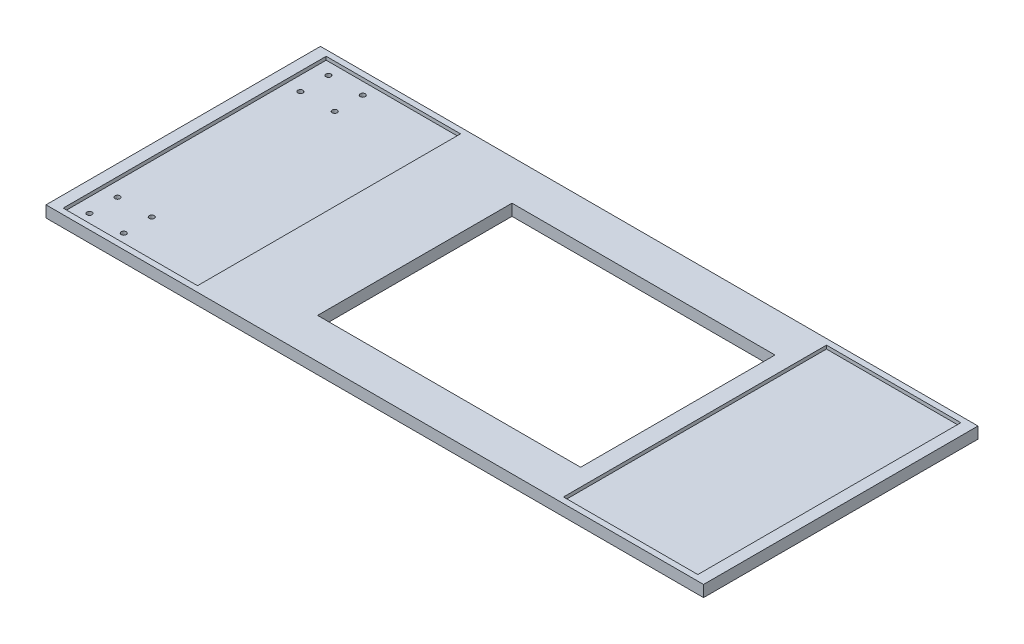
from build123d import *

# Parameters (mm, degrees)
SKETCH_1_W               = 575
SKETCH_1_H               = 240
EXTRUDE_1_DEPTH          = 31.5
SKETCH_2_W               = 117.5
SKETCH_2_H               = 230
CUT_EXTRUDE_1_DEPTH      = 24.5
SKETCH_3_W               = 230
SKETCH_3_H               = 170
CUT_EXTRUDE_2_DEPTH      = 314.126971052
SKETCH_4_R               = 9
EXTRUDE_2_DEPTH          = 5
SKETCH_5_R               = 6
SKETCH_5_R_2             = 4
CUT_EXTRUDE_3_DEPTH      = 10
SKETCH_6_R               = 2.2
CUT_EXTRUDE_4_DEPTH      = 10
EXTRUDE_3_DEPTH          = 31.5
HOLE_WIZARD_M10_1_D      = 8.5
HOLE_WIZARD_M10_1_DEPTH  = 31
HOLE_WIZARD_M10_1_TIP    = 2.553657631
CUT_EXTRUDE_5_DEPTH      = 10
CUT_EXTRUDE_5_DEPTH_BACK = 21.5
SKETCH_11_W              = 728.102088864
SKETCH_11_H              = 268.027352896
SKETCH_12_W              = 50.425356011
SKETCH_12_H              = 238.573797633
CUT_EXTRUDE_6_DEPTH      = 64


with BuildPart() as part:
    # Sketch 1 → Extrude 1 (new body)
    with BuildSketch(Plane(origin=(0, 0, 0), x_dir=(1, 0, 0), z_dir=(0, 1, 0))):
        Rectangle(SKETCH_1_W, SKETCH_1_H)
    extrude(amount=EXTRUDE_1_DEPTH)

    # Sketch 2 → Cut-Extrude 1 (cut)
    with BuildSketch(Plane(origin=(0, 31.5, 0), x_dir=(1, 0, 0), z_dir=(0, 1, 0))):
        with Locations((-218.75, 0)):
            Rectangle(SKETCH_2_W, SKETCH_2_H)
        with Locations((218.75, 0)):
            Rectangle(SKETCH_2_W, SKETCH_2_H)
    extrude(amount=-CUT_EXTRUDE_1_DEPTH, mode=Mode.SUBTRACT)

    # Sketch 3 → Cut-Extrude 2 (cut, through all)
    with BuildSketch(Plane(origin=(0, 31.5, 0), x_dir=(1, 0, 0), z_dir=(0, 1, 0))):
        with Locations((30, 0)):
            Rectangle(SKETCH_3_W, SKETCH_3_H)
    extrude(amount=-CUT_EXTRUDE_2_DEPTH, mode=Mode.SUBTRACT)

    # Sketch 4 → Extrude 2 (add)
    with BuildSketch(Plane.XY.offset(120)):
        with Locations((-250, 31.5)):
            Circle(SKETCH_4_R)
        with Locations((250, 31.5)):
            Circle(SKETCH_4_R)
    extrude_2 = extrude(amount=-EXTRUDE_2_DEPTH)

    # Sketch 5 → Cut-Extrude 3 (cut)
    with BuildSketch(Plane.XY.offset(120)):
        with Locations((-250, 31.5)):
            Circle(SKETCH_5_R)
        with Locations((250, 31.5)):
            Circle(SKETCH_5_R_2)
    cut_extrude_3 = extrude(amount=-CUT_EXTRUDE_3_DEPTH, mode=Mode.SUBTRACT)

    # Sketch 6 → Cut-Extrude 4 (cut)
    with BuildSketch(Plane(origin=(0, 7, 0), x_dir=(1, 0, 0), z_dir=(0, 1, 0))):
        with Locations(Location((-265, -80, 0), (0, 0, 270))):
            Circle(SKETCH_6_R)
        with Locations(Location((-265, -104.5, 0), (0, 0, 270))):
            Circle(SKETCH_6_R)
        with Locations(Location((-235, -104.5, 0), (0, 0, 90))):
            Circle(SKETCH_6_R)
        with Locations(Location((-235, -80, 0), (0, 0, 90))):
            Circle(SKETCH_6_R)
    cut_extrude_4 = extrude(amount=-CUT_EXTRUDE_4_DEPTH, mode=Mode.SUBTRACT)

    # Mirror 1: Extrude 2, Cut-Extrude 3, Cut-Extrude 4 across plane
    add(extrude_2.mirror(Plane.XY))
    add(cut_extrude_3.mirror(Plane.XY), mode=Mode.SUBTRACT)
    add(cut_extrude_4.mirror(Plane.XY), mode=Mode.SUBTRACT)

    # Sketch 7 → Extrude 3 (add)
    with BuildSketch(Plane(origin=(0, 31.5, 0), x_dir=(1, 0, 0), z_dir=(0, 1, 0))):
        Polygon((-287.5, 68), (-298.5, 68), (-298.5, 0), (-298.5, -68), (-287.5, -68), (-287.5, -78), (-308.5, -78), (-308.5, 0), (-308.5, 78), (-287.5, 78), align=None)
    extrude(amount=-EXTRUDE_3_DEPTH)

    # Hole Wizard M10 _1
    with Locations(Plane(origin=(-308.5, 15.75, -45), x_dir=(0, 0, -1), z_dir=(-1, 0, 0))):
        with Locations((0, 0), (-90, 0)):
            Hole(HOLE_WIZARD_M10_1_D / 2, depth=HOLE_WIZARD_M10_1_DEPTH)
            with Locations((0, 0, -(HOLE_WIZARD_M10_1_DEPTH + HOLE_WIZARD_M10_1_TIP / 2))):  # 118° drill point
                Cone(0, HOLE_WIZARD_M10_1_D / 2, HOLE_WIZARD_M10_1_TIP, mode=Mode.SUBTRACT)

    # Sketch 11 → Cut-Extrude 5 (cut, two sides: drawn at the far end of the back side and taken through both)
    with BuildSketch(Plane(origin=(0, 31.5, 0), x_dir=(1, 0, 0), z_dir=(0, 1, 0)).offset(-CUT_EXTRUDE_5_DEPTH_BACK)):
        Rectangle(SKETCH_11_W, SKETCH_11_H)
    extrude(amount=CUT_EXTRUDE_5_DEPTH + CUT_EXTRUDE_5_DEPTH_BACK, mode=Mode.SUBTRACT)

    # Sketch 12 → Cut-Extrude 6 (cut)
    with BuildSketch(Plane(origin=(0, 10, 0), x_dir=(1, 0, 0), z_dir=(0, 1, 0))):
        with Locations((-312.712678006, 14.726777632)):
            Rectangle(SKETCH_12_W, SKETCH_12_H)
    extrude(amount=-CUT_EXTRUDE_6_DEPTH, mode=Mode.SUBTRACT)


solid = part.part
